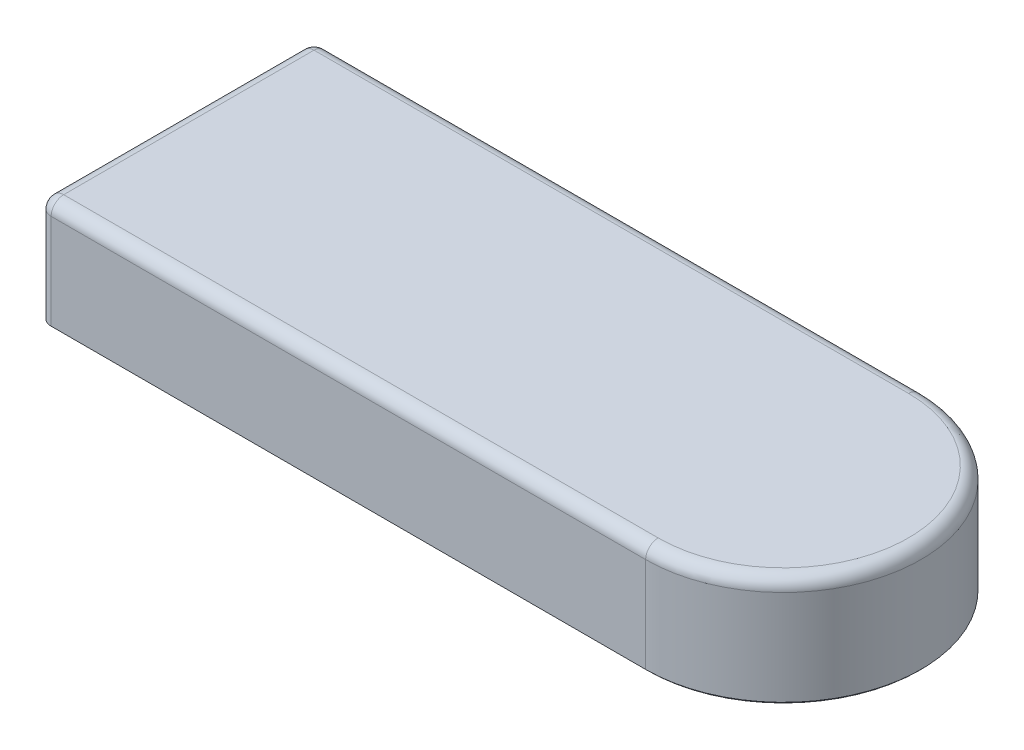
ISO-10303-21;
HEADER;
FILE_DESCRIPTION(('STEP AP214'),'2;1');
FILE_NAME('part.step','',(''),(''),'','','');
FILE_SCHEMA(('AUTOMOTIVE_DESIGN { 1 0 10303 214 1 1 1 1 }'));
ENDSEC;
DATA;
#1=APPLICATION_CONTEXT('core data for automotive mechanical design processes');
#2=APPLICATION_PROTOCOL_DEFINITION('international standard','automotive_design',2000,#1);
#3=PRODUCT_CONTEXT('',#1,'mechanical');
#4=PRODUCT('Part','Part','',(#3));
#5=PRODUCT_RELATED_PRODUCT_CATEGORY('part','',(#4));
#6=PRODUCT_DEFINITION_FORMATION('','',#4);
#7=PRODUCT_DEFINITION_CONTEXT('part definition',#1,'design');
#8=PRODUCT_DEFINITION('design','',#6,#7);
#9=PRODUCT_DEFINITION_SHAPE('','',#8);
#10=(LENGTH_UNIT() NAMED_UNIT(*) SI_UNIT(.MILLI.,.METRE.));
#11=(NAMED_UNIT(*) PLANE_ANGLE_UNIT() SI_UNIT($,.RADIAN.));
#12=(NAMED_UNIT(*) SI_UNIT($,.STERADIAN.) SOLID_ANGLE_UNIT());
#13=UNCERTAINTY_MEASURE_WITH_UNIT(LENGTH_MEASURE(1.E-05),#10,'distance_accuracy_value','');
#14=(GEOMETRIC_REPRESENTATION_CONTEXT(3) GLOBAL_UNCERTAINTY_ASSIGNED_CONTEXT((#13)) GLOBAL_UNIT_ASSIGNED_CONTEXT((#10,
#11,#12)) REPRESENTATION_CONTEXT('',''));
#15=CARTESIAN_POINT('',(0.,0.,0.));
#16=DIRECTION('',(0.,0.,1.));
#17=DIRECTION('',(1.,0.,0.));
#18=AXIS2_PLACEMENT_3D('',#15,#16,#17);
#19=CARTESIAN_POINT('',(97.,17.5,-22.));
#20=DIRECTION('',(0.,-1.,0.));
#21=DIRECTION('',(0.,0.,-1.));
#22=AXIS2_PLACEMENT_3D('',#19,#20,#21);
#23=CYLINDRICAL_SURFACE('',#22,22.);
#24=DIRECTION('',(0.,-1.,0.));
#25=VECTOR('',#24,1.);
#26=CARTESIAN_POINT('',(97.,17.5,0.));
#27=LINE('',#26,#25);
#28=CARTESIAN_POINT('',(97.,15.5,0.));
#29=VERTEX_POINT('',#28);
#30=CARTESIAN_POINT('',(97.,0.300000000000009,0.));
#31=VERTEX_POINT('',#30);
#32=EDGE_CURVE('E194',#29,#31,#27,.T.);
#33=ORIENTED_EDGE('',*,*,#32,.T.);
#34=CARTESIAN_POINT('',(97.,0.300000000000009,-22.));
#35=DIRECTION('',(0.,-1.,0.));
#36=DIRECTION('',(0.,0.,-1.));
#37=AXIS2_PLACEMENT_3D('',#34,#35,#36);
#38=CIRCLE('',#37,22.);
#39=CARTESIAN_POINT('',(97.,0.300000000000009,-44.));
#40=VERTEX_POINT('',#39);
#41=EDGE_CURVE('E11',#31,#40,#38,.F.);
#42=ORIENTED_EDGE('',*,*,#41,.T.);
#43=DIRECTION('',(0.,-1.,0.));
#44=VECTOR('',#43,1.);
#45=CARTESIAN_POINT('',(97.,17.5,-44.));
#46=LINE('',#45,#44);
#47=CARTESIAN_POINT('',(97.,15.5,-44.));
#48=VERTEX_POINT('',#47);
#49=EDGE_CURVE('E161',#48,#40,#46,.T.);
#50=ORIENTED_EDGE('',*,*,#49,.F.);
#51=CARTESIAN_POINT('',(97.,15.5,-22.));
#52=DIRECTION('',(0.,-1.,0.));
#53=DIRECTION('',(0.,0.,-1.));
#54=AXIS2_PLACEMENT_3D('',#51,#52,#53);
#55=CIRCLE('',#54,22.);
#56=EDGE_CURVE('E180',#48,#29,#55,.T.);
#57=ORIENTED_EDGE('',*,*,#56,.T.);
#58=EDGE_LOOP('',(#33,#42,#50,#57));
#59=FACE_BOUND('',#58,.T.);
#60=ADVANCED_FACE('F50',(#59),#23,.T.);
#61=CARTESIAN_POINT('',(2.00000000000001,17.5,-44.));
#62=DIRECTION('',(0.,0.,1.));
#63=DIRECTION('',(1.,0.,0.));
#64=AXIS2_PLACEMENT_3D('',#61,#62,#63);
#65=PLANE('',#64);
#66=ORIENTED_EDGE('',*,*,#49,.T.);
#67=DIRECTION('',(-1.,0.,0.));
#68=VECTOR('',#67,1.);
#69=CARTESIAN_POINT('',(2.00000000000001,0.300000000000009,-44.));
#70=LINE('',#69,#68);
#71=CARTESIAN_POINT('',(2.00000000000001,0.300000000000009,-44.));
#72=VERTEX_POINT('',#71);
#73=EDGE_CURVE('E181',#40,#72,#70,.T.);
#74=ORIENTED_EDGE('',*,*,#73,.T.);
#75=DIRECTION('',(0.,-1.,0.));
#76=VECTOR('',#75,1.);
#77=CARTESIAN_POINT('',(2.00000000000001,17.5,-44.));
#78=LINE('',#77,#76);
#79=CARTESIAN_POINT('',(2.00000000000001,15.5,-44.));
#80=VERTEX_POINT('',#79);
#81=EDGE_CURVE('E265',#80,#72,#78,.T.);
#82=ORIENTED_EDGE('',*,*,#81,.F.);
#83=DIRECTION('',(-1.,0.,0.));
#84=VECTOR('',#83,1.);
#85=CARTESIAN_POINT('',(2.00000000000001,15.5,-44.));
#86=LINE('',#85,#84);
#87=EDGE_CURVE('E178',#80,#48,#86,.F.);
#88=ORIENTED_EDGE('',*,*,#87,.T.);
#89=EDGE_LOOP('',(#66,#74,#82,#88));
#90=FACE_BOUND('',#89,.T.);
#91=ADVANCED_FACE('F261',(#90),#65,.F.);
#92=CARTESIAN_POINT('',(2.,17.5,-42.));
#93=DIRECTION('',(0.,-1.,0.));
#94=DIRECTION('',(0.,0.,-1.));
#95=AXIS2_PLACEMENT_3D('',#92,#93,#94);
#96=CYLINDRICAL_SURFACE('',#95,2.);
#97=ORIENTED_EDGE('',*,*,#81,.T.);
#98=CARTESIAN_POINT('',(2.,0.300000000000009,-42.));
#99=DIRECTION('',(0.,-1.,0.));
#100=DIRECTION('',(0.,0.,-1.));
#101=AXIS2_PLACEMENT_3D('',#98,#99,#100);
#102=CIRCLE('',#101,2.);
#103=CARTESIAN_POINT('',(0.,0.300000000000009,-42.));
#104=VERTEX_POINT('',#103);
#105=EDGE_CURVE('E213',#72,#104,#102,.F.);
#106=ORIENTED_EDGE('',*,*,#105,.T.);
#107=DIRECTION('',(0.,-1.,0.));
#108=VECTOR('',#107,1.);
#109=CARTESIAN_POINT('',(0.,17.5,-42.));
#110=LINE('',#109,#108);
#111=CARTESIAN_POINT('',(0.,15.5,-42.));
#112=VERTEX_POINT('',#111);
#113=EDGE_CURVE('E267',#112,#104,#110,.T.);
#114=ORIENTED_EDGE('',*,*,#113,.F.);
#115=CARTESIAN_POINT('',(2.,15.5,-42.));
#116=DIRECTION('',(0.,-1.,0.));
#117=DIRECTION('',(0.,0.,-1.));
#118=AXIS2_PLACEMENT_3D('',#115,#116,#117);
#119=CIRCLE('',#118,2.);
#120=EDGE_CURVE('E176',#112,#80,#119,.T.);
#121=ORIENTED_EDGE('',*,*,#120,.T.);
#122=EDGE_LOOP('',(#97,#106,#114,#121));
#123=FACE_BOUND('',#122,.T.);
#124=ADVANCED_FACE('F321',(#123),#96,.T.);
#125=CARTESIAN_POINT('',(0.,17.5,-2.00000000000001));
#126=DIRECTION('',(1.,0.,0.));
#127=DIRECTION('',(0.,0.,-1.));
#128=AXIS2_PLACEMENT_3D('',#125,#126,#127);
#129=PLANE('',#128);
#130=ORIENTED_EDGE('',*,*,#113,.T.);
#131=DIRECTION('',(0.,0.,1.));
#132=VECTOR('',#131,1.);
#133=CARTESIAN_POINT('',(0.,0.300000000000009,-2.00000000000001));
#134=LINE('',#133,#132);
#135=CARTESIAN_POINT('',(0.,0.300000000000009,-2.00000000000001));
#136=VERTEX_POINT('',#135);
#137=EDGE_CURVE('E215',#104,#136,#134,.T.);
#138=ORIENTED_EDGE('',*,*,#137,.T.);
#139=DIRECTION('',(0.,-1.,0.));
#140=VECTOR('',#139,1.);
#141=CARTESIAN_POINT('',(0.,17.5,-2.00000000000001));
#142=LINE('',#141,#140);
#143=CARTESIAN_POINT('',(0.,15.5,-2.00000000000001));
#144=VERTEX_POINT('',#143);
#145=EDGE_CURVE('E289',#144,#136,#142,.T.);
#146=ORIENTED_EDGE('',*,*,#145,.F.);
#147=DIRECTION('',(0.,0.,1.));
#148=VECTOR('',#147,1.);
#149=CARTESIAN_POINT('',(0.,15.5,-2.00000000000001));
#150=LINE('',#149,#148);
#151=EDGE_CURVE('E174',#144,#112,#150,.F.);
#152=ORIENTED_EDGE('',*,*,#151,.T.);
#153=EDGE_LOOP('',(#130,#138,#146,#152));
#154=FACE_BOUND('',#153,.T.);
#155=ADVANCED_FACE('F297',(#154),#129,.F.);
#156=CARTESIAN_POINT('',(2.,17.5,-2.));
#157=DIRECTION('',(0.,-1.,0.));
#158=DIRECTION('',(0.,0.,-1.));
#159=AXIS2_PLACEMENT_3D('',#156,#157,#158);
#160=CYLINDRICAL_SURFACE('',#159,2.);
#161=ORIENTED_EDGE('',*,*,#145,.T.);
#162=CARTESIAN_POINT('',(2.,0.300000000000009,-2.));
#163=DIRECTION('',(0.,-1.,0.));
#164=DIRECTION('',(0.,0.,-1.));
#165=AXIS2_PLACEMENT_3D('',#162,#163,#164);
#166=CIRCLE('',#165,2.);
#167=CARTESIAN_POINT('',(2.00000000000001,0.300000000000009,0.));
#168=VERTEX_POINT('',#167);
#169=EDGE_CURVE('E78',#136,#168,#166,.F.);
#170=ORIENTED_EDGE('',*,*,#169,.T.);
#171=DIRECTION('',(0.,-1.,0.));
#172=VECTOR('',#171,1.);
#173=CARTESIAN_POINT('',(2.00000000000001,17.5,0.));
#174=LINE('',#173,#172);
#175=CARTESIAN_POINT('',(2.00000000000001,15.5,0.));
#176=VERTEX_POINT('',#175);
#177=EDGE_CURVE('E286',#176,#168,#174,.T.);
#178=ORIENTED_EDGE('',*,*,#177,.F.);
#179=CARTESIAN_POINT('',(2.,15.5,-2.));
#180=DIRECTION('',(0.,-1.,0.));
#181=DIRECTION('',(0.,0.,-1.));
#182=AXIS2_PLACEMENT_3D('',#179,#180,#181);
#183=CIRCLE('',#182,2.);
#184=EDGE_CURVE('E168',#176,#144,#183,.T.);
#185=ORIENTED_EDGE('',*,*,#184,.T.);
#186=EDGE_LOOP('',(#161,#170,#178,#185));
#187=FACE_BOUND('',#186,.T.);
#188=ADVANCED_FACE('F287',(#187),#160,.T.);
#189=CARTESIAN_POINT('',(2.00000000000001,17.5,0.));
#190=DIRECTION('',(0.,0.,-1.));
#191=DIRECTION('',(-1.,0.,0.));
#192=AXIS2_PLACEMENT_3D('',#189,#190,#191);
#193=PLANE('',#192);
#194=ORIENTED_EDGE('',*,*,#177,.T.);
#195=DIRECTION('',(1.,0.,0.));
#196=VECTOR('',#195,1.);
#197=CARTESIAN_POINT('',(97.,0.300000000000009,0.));
#198=LINE('',#197,#196);
#199=EDGE_CURVE('E60',#168,#31,#198,.T.);
#200=ORIENTED_EDGE('',*,*,#199,.T.);
#201=ORIENTED_EDGE('',*,*,#32,.F.);
#202=DIRECTION('',(1.,0.,0.));
#203=VECTOR('',#202,1.);
#204=CARTESIAN_POINT('',(2.00000000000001,15.5,0.));
#205=LINE('',#204,#203);
#206=EDGE_CURVE('E148',#29,#176,#205,.F.);
#207=ORIENTED_EDGE('',*,*,#206,.T.);
#208=EDGE_LOOP('',(#194,#200,#201,#207));
#209=FACE_BOUND('',#208,.T.);
#210=ADVANCED_FACE('F285',(#209),#193,.F.);
#211=CARTESIAN_POINT('',(97.,17.5,-22.));
#212=DIRECTION('',(0.,-1.,0.));
#213=DIRECTION('',(0.,0.,-1.));
#214=AXIS2_PLACEMENT_3D('',#211,#212,#213);
#215=PLANE('',#214);
#216=DIRECTION('',(0.,0.,1.));
#217=VECTOR('',#216,1.);
#218=CARTESIAN_POINT('',(2.,17.5,-22.));
#219=LINE('',#218,#217);
#220=CARTESIAN_POINT('',(2.,17.5,-42.));
#221=VERTEX_POINT('',#220);
#222=CARTESIAN_POINT('',(2.,17.5,-2.));
#223=VERTEX_POINT('',#222);
#224=EDGE_CURVE('E165',#221,#223,#219,.T.);
#225=ORIENTED_EDGE('',*,*,#224,.T.);
#226=DIRECTION('',(1.,0.,0.));
#227=VECTOR('',#226,1.);
#228=CARTESIAN_POINT('',(97.,17.5,-2.));
#229=LINE('',#228,#227);
#230=CARTESIAN_POINT('',(97.,17.5,-2.));
#231=VERTEX_POINT('',#230);
#232=EDGE_CURVE('E146',#223,#231,#229,.T.);
#233=ORIENTED_EDGE('',*,*,#232,.T.);
#234=CARTESIAN_POINT('',(97.,17.5,-22.));
#235=DIRECTION('',(0.,-1.,0.));
#236=DIRECTION('',(0.,0.,-1.));
#237=AXIS2_PLACEMENT_3D('',#234,#235,#236);
#238=CIRCLE('',#237,20.);
#239=CARTESIAN_POINT('',(97.,17.5,-42.));
#240=VERTEX_POINT('',#239);
#241=EDGE_CURVE('E154',#231,#240,#238,.F.);
#242=ORIENTED_EDGE('',*,*,#241,.T.);
#243=DIRECTION('',(-1.,0.,0.));
#244=VECTOR('',#243,1.);
#245=CARTESIAN_POINT('',(97.,17.5,-42.));
#246=LINE('',#245,#244);
#247=EDGE_CURVE('E160',#240,#221,#246,.T.);
#248=ORIENTED_EDGE('',*,*,#247,.T.);
#249=EDGE_LOOP('',(#225,#233,#242,#248));
#250=FACE_BOUND('',#249,.T.);
#251=ADVANCED_FACE('F163',(#250),#215,.F.);
#252=CARTESIAN_POINT('',(97.,0.,-22.));
#253=DIRECTION('',(0.,-1.,0.));
#254=DIRECTION('',(0.,0.,-1.));
#255=AXIS2_PLACEMENT_3D('',#252,#253,#254);
#256=PLANE('',#255);
#257=CARTESIAN_POINT('',(2.,0.,-42.));
#258=DIRECTION('',(0.,-1.,0.));
#259=DIRECTION('',(0.,0.,-1.));
#260=AXIS2_PLACEMENT_3D('',#257,#258,#259);
#261=CIRCLE('',#260,1.70000000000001);
#262=CARTESIAN_POINT('',(0.299999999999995,0.,-42.));
#263=VERTEX_POINT('',#262);
#264=CARTESIAN_POINT('',(2.00000000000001,0.,-43.7));
#265=VERTEX_POINT('',#264);
#266=EDGE_CURVE('E208',#263,#265,#261,.T.);
#267=ORIENTED_EDGE('',*,*,#266,.T.);
#268=DIRECTION('',(1.,0.,0.));
#269=VECTOR('',#268,1.);
#270=CARTESIAN_POINT('',(97.,0.,-43.7));
#271=LINE('',#270,#269);
#272=CARTESIAN_POINT('',(97.,0.,-43.7));
#273=VERTEX_POINT('',#272);
#274=EDGE_CURVE('E210',#265,#273,#271,.T.);
#275=ORIENTED_EDGE('',*,*,#274,.T.);
#276=CARTESIAN_POINT('',(97.,0.,-22.));
#277=DIRECTION('',(0.,-1.,0.));
#278=DIRECTION('',(0.,0.,-1.));
#279=AXIS2_PLACEMENT_3D('',#276,#277,#278);
#280=CIRCLE('',#279,21.7);
#281=CARTESIAN_POINT('',(97.,0.,-0.299999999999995));
#282=VERTEX_POINT('',#281);
#283=EDGE_CURVE('E197',#273,#282,#280,.T.);
#284=ORIENTED_EDGE('',*,*,#283,.T.);
#285=DIRECTION('',(-1.,0.,0.));
#286=VECTOR('',#285,1.);
#287=CARTESIAN_POINT('',(2.00000000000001,0.,-0.299999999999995));
#288=LINE('',#287,#286);
#289=CARTESIAN_POINT('',(2.00000000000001,0.,-0.299999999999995));
#290=VERTEX_POINT('',#289);
#291=EDGE_CURVE('E199',#282,#290,#288,.T.);
#292=ORIENTED_EDGE('',*,*,#291,.T.);
#293=CARTESIAN_POINT('',(2.,0.,-2.));
#294=DIRECTION('',(0.,-1.,0.));
#295=DIRECTION('',(0.,0.,-1.));
#296=AXIS2_PLACEMENT_3D('',#293,#294,#295);
#297=CIRCLE('',#296,1.70000000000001);
#298=CARTESIAN_POINT('',(0.299999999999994,0.,-2.00000000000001));
#299=VERTEX_POINT('',#298);
#300=EDGE_CURVE('E202',#290,#299,#297,.T.);
#301=ORIENTED_EDGE('',*,*,#300,.T.);
#302=DIRECTION('',(0.,0.,-1.));
#303=VECTOR('',#302,1.);
#304=CARTESIAN_POINT('',(0.299999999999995,0.,-42.));
#305=LINE('',#304,#303);
#306=EDGE_CURVE('E205',#299,#263,#305,.T.);
#307=ORIENTED_EDGE('',*,*,#306,.T.);
#308=EDGE_LOOP('',(#267,#275,#284,#292,#301,#307));
#309=FACE_BOUND('',#308,.T.);
#310=ADVANCED_FACE('F248',(#309),#256,.T.);
#311=CARTESIAN_POINT('',(2.,15.5,-42.));
#312=DIRECTION('',(0.,-1.,0.));
#313=DIRECTION('',(0.,0.,-1.));
#314=AXIS2_PLACEMENT_3D('',#311,#312,#313);
#315=SPHERICAL_SURFACE('',#314,2.);
#316=CARTESIAN_POINT('',(2.,15.5,-42.));
#317=DIRECTION('',(1.,0.,0.));
#318=DIRECTION('',(0.,0.,-1.));
#319=AXIS2_PLACEMENT_3D('',#316,#317,#318);
#320=CIRCLE('',#319,2.);
#321=EDGE_CURVE('E188',#80,#221,#320,.T.);
#322=ORIENTED_EDGE('',*,*,#321,.F.);
#323=ORIENTED_EDGE('',*,*,#120,.F.);
#324=CARTESIAN_POINT('',(2.,15.5,-42.));
#325=DIRECTION('',(0.,0.,1.));
#326=DIRECTION('',(1.,0.,0.));
#327=AXIS2_PLACEMENT_3D('',#324,#325,#326);
#328=CIRCLE('',#327,2.);
#329=EDGE_CURVE('E191',#221,#112,#328,.T.);
#330=ORIENTED_EDGE('',*,*,#329,.F.);
#331=EDGE_LOOP('',(#322,#323,#330));
#332=FACE_BOUND('',#331,.T.);
#333=ADVANCED_FACE('F276',(#332),#315,.T.);
#334=CARTESIAN_POINT('',(2.,15.5,-22.));
#335=DIRECTION('',(0.,0.,1.));
#336=DIRECTION('',(1.,0.,0.));
#337=AXIS2_PLACEMENT_3D('',#334,#335,#336);
#338=CYLINDRICAL_SURFACE('',#337,2.);
#339=ORIENTED_EDGE('',*,*,#329,.T.);
#340=ORIENTED_EDGE('',*,*,#151,.F.);
#341=CARTESIAN_POINT('',(2.,15.5,-2.));
#342=DIRECTION('',(0.,0.,1.));
#343=DIRECTION('',(1.,0.,0.));
#344=AXIS2_PLACEMENT_3D('',#341,#342,#343);
#345=CIRCLE('',#344,2.);
#346=EDGE_CURVE('E185',#223,#144,#345,.T.);
#347=ORIENTED_EDGE('',*,*,#346,.F.);
#348=ORIENTED_EDGE('',*,*,#224,.F.);
#349=EDGE_LOOP('',(#339,#340,#347,#348));
#350=FACE_BOUND('',#349,.T.);
#351=ADVANCED_FACE('F279',(#350),#338,.T.);
#352=CARTESIAN_POINT('',(97.,15.5,-42.));
#353=DIRECTION('',(-1.,0.,0.));
#354=DIRECTION('',(0.,0.,1.));
#355=AXIS2_PLACEMENT_3D('',#352,#353,#354);
#356=CYLINDRICAL_SURFACE('',#355,2.);
#357=ORIENTED_EDGE('',*,*,#321,.T.);
#358=ORIENTED_EDGE('',*,*,#247,.F.);
#359=CARTESIAN_POINT('',(97.,15.5,-42.));
#360=DIRECTION('',(1.,0.,0.));
#361=DIRECTION('',(0.,0.,-1.));
#362=AXIS2_PLACEMENT_3D('',#359,#360,#361);
#363=CIRCLE('',#362,2.);
#364=EDGE_CURVE('E157',#48,#240,#363,.T.);
#365=ORIENTED_EDGE('',*,*,#364,.F.);
#366=ORIENTED_EDGE('',*,*,#87,.F.);
#367=EDGE_LOOP('',(#357,#358,#365,#366));
#368=FACE_BOUND('',#367,.T.);
#369=ADVANCED_FACE('F273',(#368),#356,.T.);
#370=CARTESIAN_POINT('',(2.,15.5,-2.));
#371=DIRECTION('',(0.,-1.,0.));
#372=DIRECTION('',(0.,0.,-1.));
#373=AXIS2_PLACEMENT_3D('',#370,#371,#372);
#374=SPHERICAL_SURFACE('',#373,2.);
#375=ORIENTED_EDGE('',*,*,#346,.T.);
#376=ORIENTED_EDGE('',*,*,#184,.F.);
#377=CARTESIAN_POINT('',(2.,15.5,-2.));
#378=DIRECTION('',(1.,0.,0.));
#379=DIRECTION('',(0.,0.,-1.));
#380=AXIS2_PLACEMENT_3D('',#377,#378,#379);
#381=CIRCLE('',#380,2.);
#382=EDGE_CURVE('E151',#223,#176,#381,.T.);
#383=ORIENTED_EDGE('',*,*,#382,.F.);
#384=EDGE_LOOP('',(#375,#376,#383));
#385=FACE_BOUND('',#384,.T.);
#386=ADVANCED_FACE('F283',(#385),#374,.T.);
#387=CARTESIAN_POINT('',(97.,15.5,-22.));
#388=DIRECTION('',(0.,-1.,0.));
#389=DIRECTION('',(0.,0.,-1.));
#390=AXIS2_PLACEMENT_3D('',#387,#388,#389);
#391=TOROIDAL_SURFACE('',#390,20.,2.);
#392=ORIENTED_EDGE('',*,*,#364,.T.);
#393=ORIENTED_EDGE('',*,*,#241,.F.);
#394=CARTESIAN_POINT('',(97.,15.5,-2.));
#395=DIRECTION('',(-1.,0.,0.));
#396=DIRECTION('',(0.,0.,1.));
#397=AXIS2_PLACEMENT_3D('',#394,#395,#396);
#398=CIRCLE('',#397,2.);
#399=EDGE_CURVE('E142',#29,#231,#398,.T.);
#400=ORIENTED_EDGE('',*,*,#399,.F.);
#401=ORIENTED_EDGE('',*,*,#56,.F.);
#402=EDGE_LOOP('',(#392,#393,#400,#401));
#403=FACE_BOUND('',#402,.T.);
#404=ADVANCED_FACE('F155',(#403),#391,.T.);
#405=CARTESIAN_POINT('',(97.,15.5,-2.));
#406=DIRECTION('',(1.,0.,0.));
#407=DIRECTION('',(0.,0.,-1.));
#408=AXIS2_PLACEMENT_3D('',#405,#406,#407);
#409=CYLINDRICAL_SURFACE('',#408,2.);
#410=ORIENTED_EDGE('',*,*,#382,.T.);
#411=ORIENTED_EDGE('',*,*,#206,.F.);
#412=ORIENTED_EDGE('',*,*,#399,.T.);
#413=ORIENTED_EDGE('',*,*,#232,.F.);
#414=EDGE_LOOP('',(#410,#411,#412,#413));
#415=FACE_BOUND('',#414,.T.);
#416=ADVANCED_FACE('F144',(#415),#409,.T.);
#417=CARTESIAN_POINT('',(2.,0.300000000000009,-2.));
#418=DIRECTION('',(0.,1.,0.));
#419=DIRECTION('',(0.,0.,1.));
#420=AXIS2_PLACEMENT_3D('',#417,#418,#419);
#421=CONICAL_SURFACE('',#420,2.,0.785398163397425);
#422=DIRECTION('',(-0.707106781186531,0.707106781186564,0.));
#423=VECTOR('',#422,1.);
#424=CARTESIAN_POINT('',(0.299999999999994,0.,-2.00000000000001));
#425=LINE('',#424,#423);
#426=EDGE_CURVE('E231',#299,#136,#425,.T.);
#427=ORIENTED_EDGE('',*,*,#426,.F.);
#428=ORIENTED_EDGE('',*,*,#300,.F.);
#429=DIRECTION('',(0.,-0.707106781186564,-0.707106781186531));
#430=VECTOR('',#429,1.);
#431=CARTESIAN_POINT('',(2.00000000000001,0.300000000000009,0.));
#432=LINE('',#431,#430);
#433=EDGE_CURVE('E55',#168,#290,#432,.T.);
#434=ORIENTED_EDGE('',*,*,#433,.F.);
#435=ORIENTED_EDGE('',*,*,#169,.F.);
#436=EDGE_LOOP('',(#427,#428,#434,#435));
#437=FACE_BOUND('',#436,.T.);
#438=ADVANCED_FACE('F53',(#437),#421,.T.);
#439=CARTESIAN_POINT('',(2.00000000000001,0.300000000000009,0.));
#440=DIRECTION('',(0.,-0.707106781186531,0.707106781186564));
#441=DIRECTION('',(-1.,0.,0.));
#442=AXIS2_PLACEMENT_3D('',#439,#440,#441);
#443=PLANE('',#442);
#444=ORIENTED_EDGE('',*,*,#433,.T.);
#445=ORIENTED_EDGE('',*,*,#291,.F.);
#446=DIRECTION('',(0.,-0.707106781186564,-0.707106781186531));
#447=VECTOR('',#446,1.);
#448=CARTESIAN_POINT('',(97.,0.300000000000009,0.));
#449=LINE('',#448,#447);
#450=EDGE_CURVE('E229',#31,#282,#449,.T.);
#451=ORIENTED_EDGE('',*,*,#450,.F.);
#452=ORIENTED_EDGE('',*,*,#199,.F.);
#453=EDGE_LOOP('',(#444,#445,#451,#452));
#454=FACE_BOUND('',#453,.T.);
#455=ADVANCED_FACE('F243',(#454),#443,.T.);
#456=CARTESIAN_POINT('',(0.,0.300000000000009,-2.00000000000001));
#457=DIRECTION('',(-0.707106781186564,-0.707106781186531,0.));
#458=DIRECTION('',(0.,0.,-1.));
#459=AXIS2_PLACEMENT_3D('',#456,#457,#458);
#460=PLANE('',#459);
#461=ORIENTED_EDGE('',*,*,#426,.T.);
#462=ORIENTED_EDGE('',*,*,#137,.F.);
#463=DIRECTION('',(-0.707106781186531,0.707106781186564,0.));
#464=VECTOR('',#463,1.);
#465=CARTESIAN_POINT('',(0.299999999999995,0.,-42.));
#466=LINE('',#465,#464);
#467=EDGE_CURVE('E226',#263,#104,#466,.T.);
#468=ORIENTED_EDGE('',*,*,#467,.F.);
#469=ORIENTED_EDGE('',*,*,#306,.F.);
#470=EDGE_LOOP('',(#461,#462,#468,#469));
#471=FACE_BOUND('',#470,.T.);
#472=ADVANCED_FACE('F299',(#471),#460,.T.);
#473=CARTESIAN_POINT('',(97.,0.300000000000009,-22.));
#474=DIRECTION('',(0.,1.,0.));
#475=DIRECTION('',(0.,0.,1.));
#476=AXIS2_PLACEMENT_3D('',#473,#474,#475);
#477=CONICAL_SURFACE('',#476,22.,0.785398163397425);
#478=ORIENTED_EDGE('',*,*,#450,.T.);
#479=ORIENTED_EDGE('',*,*,#283,.F.);
#480=DIRECTION('',(0.,-0.707106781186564,0.707106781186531));
#481=VECTOR('',#480,1.);
#482=CARTESIAN_POINT('',(97.,0.300000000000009,-44.));
#483=LINE('',#482,#481);
#484=EDGE_CURVE('E224',#40,#273,#483,.T.);
#485=ORIENTED_EDGE('',*,*,#484,.F.);
#486=ORIENTED_EDGE('',*,*,#41,.F.);
#487=EDGE_LOOP('',(#478,#479,#485,#486));
#488=FACE_BOUND('',#487,.T.);
#489=ADVANCED_FACE('F254',(#488),#477,.T.);
#490=CARTESIAN_POINT('',(2.,0.300000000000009,-42.));
#491=DIRECTION('',(0.,1.,0.));
#492=DIRECTION('',(0.,0.,1.));
#493=AXIS2_PLACEMENT_3D('',#490,#491,#492);
#494=CONICAL_SURFACE('',#493,2.,0.785398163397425);
#495=ORIENTED_EDGE('',*,*,#467,.T.);
#496=ORIENTED_EDGE('',*,*,#105,.F.);
#497=DIRECTION('',(0.,0.707106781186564,-0.707106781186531));
#498=VECTOR('',#497,1.);
#499=CARTESIAN_POINT('',(2.00000000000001,0.,-43.7));
#500=LINE('',#499,#498);
#501=EDGE_CURVE('E222',#265,#72,#500,.T.);
#502=ORIENTED_EDGE('',*,*,#501,.F.);
#503=ORIENTED_EDGE('',*,*,#266,.F.);
#504=EDGE_LOOP('',(#495,#496,#502,#503));
#505=FACE_BOUND('',#504,.T.);
#506=ADVANCED_FACE('F303',(#505),#494,.T.);
#507=CARTESIAN_POINT('',(2.00000000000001,0.300000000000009,-44.));
#508=DIRECTION('',(0.,-0.707106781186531,-0.707106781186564));
#509=DIRECTION('',(1.,0.,0.));
#510=AXIS2_PLACEMENT_3D('',#507,#508,#509);
#511=PLANE('',#510);
#512=ORIENTED_EDGE('',*,*,#484,.T.);
#513=ORIENTED_EDGE('',*,*,#274,.F.);
#514=ORIENTED_EDGE('',*,*,#501,.T.);
#515=ORIENTED_EDGE('',*,*,#73,.F.);
#516=EDGE_LOOP('',(#512,#513,#514,#515));
#517=FACE_BOUND('',#516,.T.);
#518=ADVANCED_FACE('F306',(#517),#511,.T.);
#519=CLOSED_SHELL('',(#60,#91,#124,#155,#188,#210,#251,#310,#333,#351,#369,#386,#404,#416,#438,
#455,#472,#489,#506,#518));
#520=MANIFOLD_SOLID_BREP('B2',#519);
#521=ADVANCED_BREP_SHAPE_REPRESENTATION('',(#18,#520),#14);
#522=SHAPE_DEFINITION_REPRESENTATION(#9,#521);
ENDSEC;
END-ISO-10303-21;
